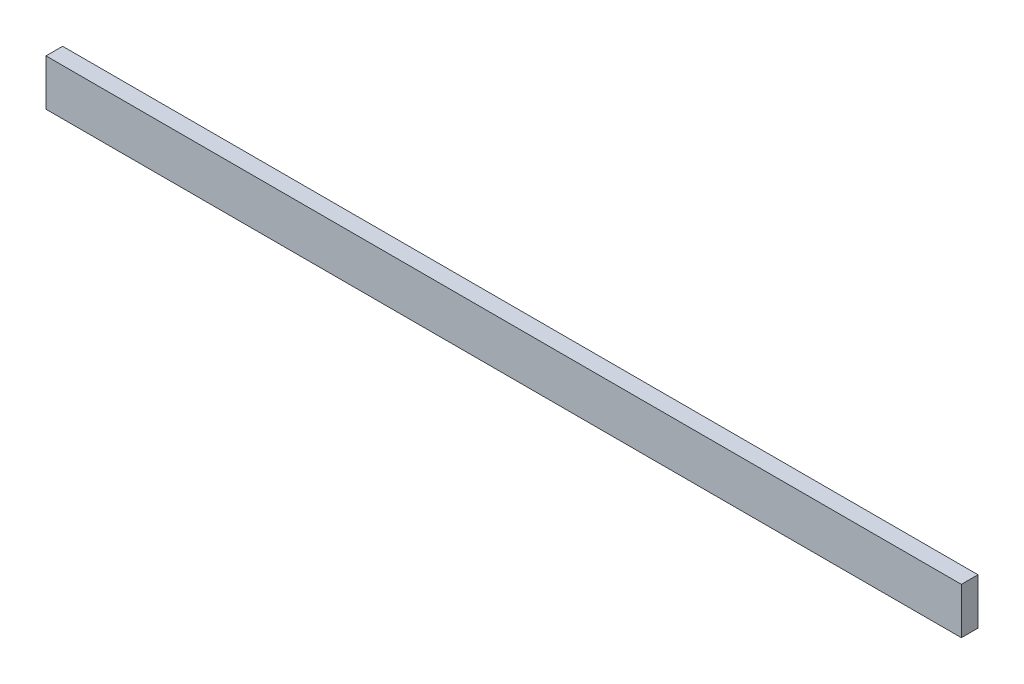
from build123d import *

# Parameters (mm, degrees)
ESBO_O1_W                = 990
ESBO_O1_H                = 50
RESSALTO_EXTRUS_O1_DEPTH = 18


with BuildPart() as part:
    # Esbo_o1 → Ressalto-extrus_o1 (new body)
    with BuildSketch(Plane.XY):
        with Locations((-523, 607)):
            Rectangle(ESBO_O1_W, ESBO_O1_H)
    extrude(amount=-RESSALTO_EXTRUS_O1_DEPTH)


solid = part.part
